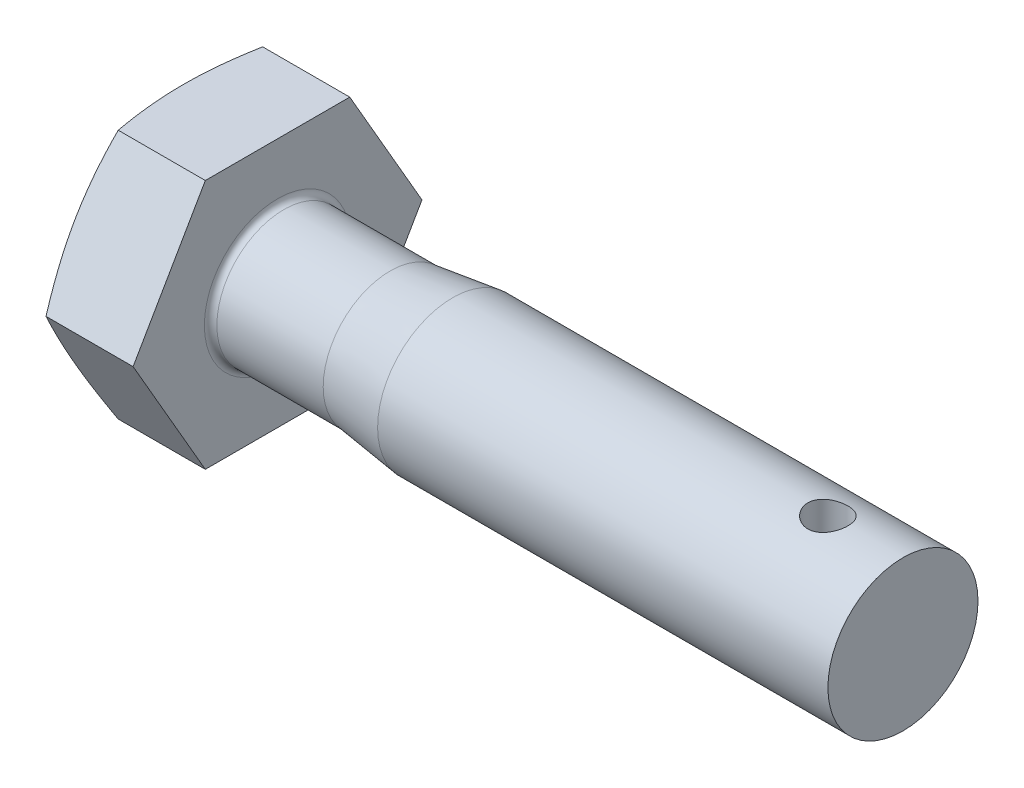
ISO-10303-21;
HEADER;
FILE_DESCRIPTION(('STEP AP214'),'2;1');
FILE_NAME('part.step','',(''),(''),'','','');
FILE_SCHEMA(('AUTOMOTIVE_DESIGN { 1 0 10303 214 1 1 1 1 }'));
ENDSEC;
DATA;
#1=APPLICATION_CONTEXT('core data for automotive mechanical design processes');
#2=APPLICATION_PROTOCOL_DEFINITION('international standard','automotive_design',2000,#1);
#3=PRODUCT_CONTEXT('',#1,'mechanical');
#4=PRODUCT('Part','Part','',(#3));
#5=PRODUCT_RELATED_PRODUCT_CATEGORY('part','',(#4));
#6=PRODUCT_DEFINITION_FORMATION('','',#4);
#7=PRODUCT_DEFINITION_CONTEXT('part definition',#1,'design');
#8=PRODUCT_DEFINITION('design','',#6,#7);
#9=PRODUCT_DEFINITION_SHAPE('','',#8);
#10=(LENGTH_UNIT() NAMED_UNIT(*) SI_UNIT(.MILLI.,.METRE.));
#11=(NAMED_UNIT(*) PLANE_ANGLE_UNIT() SI_UNIT($,.RADIAN.));
#12=(NAMED_UNIT(*) SI_UNIT($,.STERADIAN.) SOLID_ANGLE_UNIT());
#13=UNCERTAINTY_MEASURE_WITH_UNIT(LENGTH_MEASURE(1.E-05),#10,'distance_accuracy_value','');
#14=(GEOMETRIC_REPRESENTATION_CONTEXT(3) GLOBAL_UNCERTAINTY_ASSIGNED_CONTEXT((#13)) GLOBAL_UNIT_ASSIGNED_CONTEXT((#10,
#11,#12)) REPRESENTATION_CONTEXT('',''));
#15=CARTESIAN_POINT('',(0.,0.,0.));
#16=DIRECTION('',(0.,0.,1.));
#17=DIRECTION('',(1.,0.,0.));
#18=AXIS2_PLACEMENT_3D('',#15,#16,#17);
#19=CARTESIAN_POINT('',(0.,-5.,2.88675134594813));
#20=DIRECTION('',(-1.,0.,0.));
#21=DIRECTION('',(0.,0.,1.));
#22=AXIS2_PLACEMENT_3D('',#19,#20,#21);
#23=PLANE('',#22);
#24=CARTESIAN_POINT('',(0.,0.,0.));
#25=DIRECTION('',(-1.,0.,0.));
#26=DIRECTION('',(0.,0.,1.));
#27=AXIS2_PLACEMENT_3D('',#24,#25,#26);
#28=CIRCLE('',#27,4.35);
#29=CARTESIAN_POINT('',(0.,0.,4.35));
#30=VERTEX_POINT('',#29);
#31=EDGE_CURVE('E97',#30,#30,#28,.T.);
#32=ORIENTED_EDGE('',*,*,#31,.T.);
#33=EDGE_LOOP('',(#32));
#34=FACE_BOUND('',#33,.T.);
#35=CARTESIAN_POINT('',(0.,0.,0.));
#36=DIRECTION('',(1.,0.,0.));
#37=DIRECTION('',(0.,0.,-1.));
#38=AXIS2_PLACEMENT_3D('',#35,#36,#37);
#39=CIRCLE('',#38,3.4);
#40=CARTESIAN_POINT('',(0.,0.,-3.4));
#41=VERTEX_POINT('',#40);
#42=EDGE_CURVE('E230',#41,#41,#39,.T.);
#43=ORIENTED_EDGE('',*,*,#42,.T.);
#44=EDGE_LOOP('',(#43));
#45=FACE_BOUND('',#44,.T.);
#46=ADVANCED_FACE('F32',(#34,#45),#23,.T.);
#47=CARTESIAN_POINT('',(4.,-5.,2.88675134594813));
#48=DIRECTION('',(0.,1.,0.));
#49=DIRECTION('',(0.,0.,1.));
#50=AXIS2_PLACEMENT_3D('',#47,#48,#49);
#51=PLANE('',#50);
#52=CARTESIAN_POINT('',(1.73412088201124,-5.,-7.62058685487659));
#53=CARTESIAN_POINT('',(1.66536818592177,-5.,-7.39459725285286));
#54=CARTESIAN_POINT('',(1.5974227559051,-5.,-7.16835746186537));
#55=CARTESIAN_POINT('',(1.46359308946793,-5.,-6.71525017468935));
#56=CARTESIAN_POINT('',(1.39770901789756,-5.,-6.48838262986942));
#57=CARTESIAN_POINT('',(1.26833776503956,-5.,-6.03349928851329));
#58=CARTESIAN_POINT('',(1.20485534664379,-5.,-5.80548213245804));
#59=CARTESIAN_POINT('',(1.08103648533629,-5.,-5.34859642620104));
#60=CARTESIAN_POINT('',(1.02069998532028,-5.,-5.11972789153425));
#61=CARTESIAN_POINT('',(0.904681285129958,-5.,-4.66385371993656));
#62=CARTESIAN_POINT('',(0.848950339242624,-5.,-4.43686055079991));
#63=CARTESIAN_POINT('',(0.742270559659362,-5.,-3.98175526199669));
#64=CARTESIAN_POINT('',(0.691321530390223,-5.,-3.75364318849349));
#65=CARTESIAN_POINT('',(0.595395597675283,-5.,-3.29623351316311));
#66=CARTESIAN_POINT('',(0.550416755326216,-5.,-3.06693632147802));
#67=CARTESIAN_POINT('',(0.467808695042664,-5.,-2.60701194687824));
#68=CARTESIAN_POINT('',(0.43017922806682,-5.,-2.37638480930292));
#69=CARTESIAN_POINT('',(0.367531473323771,-5.,-1.93980954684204));
#70=CARTESIAN_POINT('',(0.341571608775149,-5.,-1.73399780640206));
#71=CARTESIAN_POINT('',(0.297702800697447,-5.,-1.32151095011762));
#72=CARTESIAN_POINT('',(0.279793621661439,-5.,-1.11483585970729));
#73=CARTESIAN_POINT('',(0.2528889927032,-5.,-0.701041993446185));
#74=CARTESIAN_POINT('',(0.243887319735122,-5.,-0.493923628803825));
#75=CARTESIAN_POINT('',(0.235252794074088,-5.,-0.0794895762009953));
#76=CARTESIAN_POINT('',(0.235619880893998,-5.,0.127826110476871));
#77=CARTESIAN_POINT('',(0.245728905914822,-5.,0.543296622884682));
#78=CARTESIAN_POINT('',(0.255519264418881,-5.,0.751450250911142));
#79=CARTESIAN_POINT('',(0.284025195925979,-5.,1.16714016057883));
#80=CARTESIAN_POINT('',(0.30274098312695,-5.,1.37467642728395));
#81=CARTESIAN_POINT('',(0.348227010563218,-5.,1.78903168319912));
#82=CARTESIAN_POINT('',(0.375004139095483,-5.,1.99584990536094));
#83=CARTESIAN_POINT('',(0.435533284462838,-5.,2.408451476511));
#84=CARTESIAN_POINT('',(0.469285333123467,-5.,2.61423482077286));
#85=CARTESIAN_POINT('',(0.544976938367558,-5.,3.03762754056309));
#86=CARTESIAN_POINT('',(0.587297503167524,-5.,3.25516820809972));
#87=CARTESIAN_POINT('',(0.677388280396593,-5.,3.68912540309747));
#88=CARTESIAN_POINT('',(0.72515891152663,-5.,3.90554184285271));
#89=CARTESIAN_POINT('',(0.825138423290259,-5.,4.3374083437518));
#90=CARTESIAN_POINT('',(0.877348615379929,-5.,4.55285809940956));
#91=CARTESIAN_POINT('',(0.985352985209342,-5.,4.98284735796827));
#92=CARTESIAN_POINT('',(1.04114707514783,-5.,5.19738688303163));
#93=CARTESIAN_POINT('',(1.15571790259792,-5.,5.62596240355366));
#94=CARTESIAN_POINT('',(1.2144984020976,-5.,5.83999738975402));
#95=CARTESIAN_POINT('',(1.33444153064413,-5.,6.26740010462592));
#96=CARTESIAN_POINT('',(1.395604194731,-5.,6.48076782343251));
#97=CARTESIAN_POINT('',(1.5819781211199,-5.,7.11994374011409));
#98=CARTESIAN_POINT('',(1.71009677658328,-5.,7.54490360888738));
#99=CARTESIAN_POINT('',(1.97013168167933,-5.,8.38829124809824));
#100=CARTESIAN_POINT('',(2.10198722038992,-5.,8.80673789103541));
#101=CARTESIAN_POINT('',(2.36941134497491,-5.,9.64246317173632));
#102=CARTESIAN_POINT('',(2.50498011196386,-5.,10.0597417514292));
#103=CARTESIAN_POINT('',(2.77829656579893,-5.,10.8918203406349));
#104=CARTESIAN_POINT('',(2.91603397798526,-5.,11.3066237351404));
#105=CARTESIAN_POINT('',(3.19355173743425,-5.,12.1355089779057));
#106=CARTESIAN_POINT('',(3.33333191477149,-5.,12.5495908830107));
#107=CARTESIAN_POINT('',(3.47382628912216,-5.,12.9634270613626));
#108=B_SPLINE_CURVE_WITH_KNOTS('',3,(#52,#53,#54,#55,#56,#57,#58,#59,#60,#61,#62,#63,#64,#65,
#66,#67,#68,#69,#70,#71,#72,#73,#74,#75,#76,#77,#78,#79,#80,#81,#82,#83,#84,#85,#86,#87,#88,#89,
#90,#91,#92,#93,#94,#95,#96,#97,#98,#99,#100,#101,#102,#103,#104,#105,#106,#107),.UNSPECIFIED.,
.F.,.F.,(4,2,2,2,2,2,2,2,2,2,2,2,2,2,2,2,2,2,2,2,2,2,2,2,2,2,2,4),(0.,0.708654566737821,
1.4173656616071,2.1274155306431,2.83745250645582,3.53861525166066,4.23974930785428,
4.94065510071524,5.64153713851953,6.26372739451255,6.88589944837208,7.50763652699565,
8.129369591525,8.75431450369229,9.37927441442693,10.0047698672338,10.6302681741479,
11.2950391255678,11.9598611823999,12.6248803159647,13.2898831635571,13.9557455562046,
14.6216177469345,15.9531168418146,17.269284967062,18.585517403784,19.8967329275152,
21.2078399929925),.UNSPECIFIED.);
#109=CARTESIAN_POINT('',(0.518112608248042,-5.,-2.88675134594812));
#110=VERTEX_POINT('',#109);
#111=CARTESIAN_POINT('',(0.518112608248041,-5.,2.88675134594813));
#112=VERTEX_POINT('',#111);
#113=EDGE_CURVE('E54',#110,#112,#108,.T.);
#114=ORIENTED_EDGE('',*,*,#113,.F.);
#115=DIRECTION('',(-1.,0.,0.));
#116=VECTOR('',#115,1.);
#117=CARTESIAN_POINT('',(4.,-5.,-2.88675134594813));
#118=LINE('',#117,#116);
#119=CARTESIAN_POINT('',(4.,-5.,-2.88675134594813));
#120=VERTEX_POINT('',#119);
#121=EDGE_CURVE('E122',#120,#110,#118,.T.);
#122=ORIENTED_EDGE('',*,*,#121,.F.);
#123=DIRECTION('',(0.,0.,-1.));
#124=VECTOR('',#123,1.);
#125=CARTESIAN_POINT('',(4.,-5.,2.88675134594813));
#126=LINE('',#125,#124);
#127=CARTESIAN_POINT('',(4.,-5.,2.88675134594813));
#128=VERTEX_POINT('',#127);
#129=EDGE_CURVE('E259',#128,#120,#126,.T.);
#130=ORIENTED_EDGE('',*,*,#129,.F.);
#131=DIRECTION('',(-1.,0.,0.));
#132=VECTOR('',#131,1.);
#133=CARTESIAN_POINT('',(4.,-5.,2.88675134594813));
#134=LINE('',#133,#132);
#135=EDGE_CURVE('E110',#128,#112,#134,.T.);
#136=ORIENTED_EDGE('',*,*,#135,.T.);
#137=EDGE_LOOP('',(#114,#122,#130,#136));
#138=FACE_BOUND('',#137,.T.);
#139=ADVANCED_FACE('F34',(#138),#51,.F.);
#140=CARTESIAN_POINT('',(4.,-5.,-2.88675134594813));
#141=DIRECTION('',(0.,0.5,0.866025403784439));
#142=DIRECTION('',(0.,-0.866025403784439,0.5));
#143=AXIS2_PLACEMENT_3D('',#140,#141,#142);
#144=PLANE('',#143);
#145=CARTESIAN_POINT('',(0.518154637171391,0.000200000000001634,-5.77361816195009));
#146=CARTESIAN_POINT('',(0.474622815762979,-0.206877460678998,-5.65406193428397));
#147=CARTESIAN_POINT('',(0.435023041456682,-0.414637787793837,-5.53411145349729));
#148=CARTESIAN_POINT('',(0.365353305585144,-0.83150936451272,-5.29343053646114));
#149=CARTESIAN_POINT('',(0.335290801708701,-1.04062154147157,-5.17269956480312));
#150=CARTESIAN_POINT('',(0.286665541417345,-1.45787607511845,-4.93179754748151));
#151=CARTESIAN_POINT('',(0.267996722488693,-1.66600890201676,-4.81163200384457));
#152=CARTESIAN_POINT('',(0.242956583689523,-2.08276129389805,-4.57101989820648));
#153=CARTESIAN_POINT('',(0.236580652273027,-2.29138064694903,-4.45057345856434));
#154=CARTESIAN_POINT('',(0.236580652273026,-2.70861935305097,-4.20968057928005));
#155=CARTESIAN_POINT('',(0.242956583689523,-2.91723870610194,-4.0892341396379));
#156=CARTESIAN_POINT('',(0.267996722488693,-3.33399109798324,-3.84862203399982));
#157=CARTESIAN_POINT('',(0.286665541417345,-3.54212392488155,-3.72845649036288));
#158=CARTESIAN_POINT('',(0.335290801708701,-3.95937845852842,-3.48755447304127));
#159=CARTESIAN_POINT('',(0.365353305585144,-4.16849063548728,-3.36682350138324));
#160=CARTESIAN_POINT('',(0.435023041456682,-4.58536221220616,-3.12614258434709));
#161=CARTESIAN_POINT('',(0.474622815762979,-4.793122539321,-3.00619210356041));
#162=CARTESIAN_POINT('',(0.518154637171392,-5.0002,-2.88663587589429));
#163=B_SPLINE_CURVE_WITH_KNOTS('',3,(#145,#146,#147,#148,#149,#150,#151,#152,#153,#154,#155,
#156,#157,#158,#159,#160,#161,#162),.UNSPECIFIED.,.F.,.F.,(4,2,2,2,2,2,2,2,4),(0.,
0.729203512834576,1.45897583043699,2.18184682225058,2.90444658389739,3.6270463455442,
4.3499173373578,5.07968965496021,5.80889316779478),.UNSPECIFIED.);
#164=CARTESIAN_POINT('',(0.518112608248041,0.,-5.77350269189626));
#165=VERTEX_POINT('',#164);
#166=EDGE_CURVE('E192',#165,#110,#163,.T.);
#167=ORIENTED_EDGE('',*,*,#166,.F.);
#168=DIRECTION('',(-1.,0.,0.));
#169=VECTOR('',#168,1.);
#170=CARTESIAN_POINT('',(4.,0.,-5.77350269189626));
#171=LINE('',#170,#169);
#172=CARTESIAN_POINT('',(4.,0.,-5.77350269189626));
#173=VERTEX_POINT('',#172);
#174=EDGE_CURVE('E119',#173,#165,#171,.T.);
#175=ORIENTED_EDGE('',*,*,#174,.F.);
#176=DIRECTION('',(0.,0.866025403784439,-0.5));
#177=VECTOR('',#176,1.);
#178=CARTESIAN_POINT('',(4.,-5.,-2.88675134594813));
#179=LINE('',#178,#177);
#180=EDGE_CURVE('E260',#120,#173,#179,.T.);
#181=ORIENTED_EDGE('',*,*,#180,.F.);
#182=ORIENTED_EDGE('',*,*,#121,.T.);
#183=EDGE_LOOP('',(#167,#175,#181,#182));
#184=FACE_BOUND('',#183,.T.);
#185=ADVANCED_FACE('F200',(#184),#144,.F.);
#186=CARTESIAN_POINT('',(4.,0.,-5.77350269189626));
#187=DIRECTION('',(0.,-0.5,0.866025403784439));
#188=DIRECTION('',(0.,-0.866025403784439,-0.5));
#189=AXIS2_PLACEMENT_3D('',#186,#187,#188);
#190=PLANE('',#189);
#191=CARTESIAN_POINT('',(0.518154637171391,5.0002,-2.88663587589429));
#192=CARTESIAN_POINT('',(0.474622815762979,4.793122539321,-3.00619210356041));
#193=CARTESIAN_POINT('',(0.435023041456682,4.58536221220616,-3.12614258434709));
#194=CARTESIAN_POINT('',(0.365353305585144,4.16849063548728,-3.36682350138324));
#195=CARTESIAN_POINT('',(0.335290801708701,3.95937845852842,-3.48755447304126));
#196=CARTESIAN_POINT('',(0.286665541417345,3.54212392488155,-3.72845649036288));
#197=CARTESIAN_POINT('',(0.267996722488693,3.33399109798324,-3.84862203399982));
#198=CARTESIAN_POINT('',(0.242956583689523,2.91723870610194,-4.0892341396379));
#199=CARTESIAN_POINT('',(0.236580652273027,2.70861935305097,-4.20968057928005));
#200=CARTESIAN_POINT('',(0.236580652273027,2.29138064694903,-4.45057345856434));
#201=CARTESIAN_POINT('',(0.242956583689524,2.08276129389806,-4.57101989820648));
#202=CARTESIAN_POINT('',(0.267996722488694,1.66600890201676,-4.81163200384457));
#203=CARTESIAN_POINT('',(0.286665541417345,1.45787607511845,-4.9317975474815));
#204=CARTESIAN_POINT('',(0.335290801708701,1.04062154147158,-5.17269956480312));
#205=CARTESIAN_POINT('',(0.365353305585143,0.831509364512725,-5.29343053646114));
#206=CARTESIAN_POINT('',(0.435023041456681,0.414637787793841,-5.53411145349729));
#207=CARTESIAN_POINT('',(0.474622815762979,0.206877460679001,-5.65406193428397));
#208=CARTESIAN_POINT('',(0.518154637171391,-0.000199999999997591,-5.77361816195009));
#209=B_SPLINE_CURVE_WITH_KNOTS('',3,(#191,#192,#193,#194,#195,#196,#197,#198,#199,#200,#201,
#202,#203,#204,#205,#206,#207,#208),.UNSPECIFIED.,.F.,.F.,(4,2,2,2,2,2,2,2,4),(0.,
0.729203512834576,1.45897583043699,2.18184682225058,2.90444658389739,3.6270463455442,
4.34991733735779,5.0796896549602,5.80889316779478),.UNSPECIFIED.);
#210=CARTESIAN_POINT('',(0.518112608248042,5.,-2.88675134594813));
#211=VERTEX_POINT('',#210);
#212=EDGE_CURVE('E186',#211,#165,#209,.T.);
#213=ORIENTED_EDGE('',*,*,#212,.F.);
#214=DIRECTION('',(-1.,0.,0.));
#215=VECTOR('',#214,1.);
#216=CARTESIAN_POINT('',(4.,5.,-2.88675134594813));
#217=LINE('',#216,#215);
#218=CARTESIAN_POINT('',(4.,5.,-2.88675134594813));
#219=VERTEX_POINT('',#218);
#220=EDGE_CURVE('E112',#219,#211,#217,.T.);
#221=ORIENTED_EDGE('',*,*,#220,.F.);
#222=DIRECTION('',(0.,0.866025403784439,0.5));
#223=VECTOR('',#222,1.);
#224=CARTESIAN_POINT('',(4.,0.,-5.77350269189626));
#225=LINE('',#224,#223);
#226=EDGE_CURVE('E264',#173,#219,#225,.T.);
#227=ORIENTED_EDGE('',*,*,#226,.F.);
#228=ORIENTED_EDGE('',*,*,#174,.T.);
#229=EDGE_LOOP('',(#213,#221,#227,#228));
#230=FACE_BOUND('',#229,.T.);
#231=ADVANCED_FACE('F203',(#230),#190,.F.);
#232=CARTESIAN_POINT('',(4.,5.,-2.88675134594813));
#233=DIRECTION('',(0.,-1.,0.));
#234=DIRECTION('',(0.,0.,-1.));
#235=AXIS2_PLACEMENT_3D('',#232,#233,#234);
#236=PLANE('',#235);
#237=CARTESIAN_POINT('',(1.73412088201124,5.,-7.62058685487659));
#238=CARTESIAN_POINT('',(1.66536818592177,5.,-7.39459725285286));
#239=CARTESIAN_POINT('',(1.5974227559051,5.,-7.16835746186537));
#240=CARTESIAN_POINT('',(1.46359308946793,5.,-6.71525017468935));
#241=CARTESIAN_POINT('',(1.39770901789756,5.,-6.48838262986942));
#242=CARTESIAN_POINT('',(1.26833776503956,5.,-6.03349928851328));
#243=CARTESIAN_POINT('',(1.20485534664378,5.,-5.80548213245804));
#244=CARTESIAN_POINT('',(1.08103648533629,5.,-5.34859642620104));
#245=CARTESIAN_POINT('',(1.02069998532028,5.,-5.11972789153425));
#246=CARTESIAN_POINT('',(0.904681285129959,5.,-4.66385371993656));
#247=CARTESIAN_POINT('',(0.848950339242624,5.,-4.43686055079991));
#248=CARTESIAN_POINT('',(0.742270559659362,5.,-3.98175526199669));
#249=CARTESIAN_POINT('',(0.691321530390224,5.,-3.75364318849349));
#250=CARTESIAN_POINT('',(0.595395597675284,5.,-3.29623351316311));
#251=CARTESIAN_POINT('',(0.550416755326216,5.,-3.06693632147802));
#252=CARTESIAN_POINT('',(0.467808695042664,5.,-2.60701194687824));
#253=CARTESIAN_POINT('',(0.43017922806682,5.,-2.37638480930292));
#254=CARTESIAN_POINT('',(0.367531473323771,5.,-1.93980954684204));
#255=CARTESIAN_POINT('',(0.341571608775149,5.,-1.73399780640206));
#256=CARTESIAN_POINT('',(0.297702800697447,5.,-1.32151095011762));
#257=CARTESIAN_POINT('',(0.279793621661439,5.,-1.11483585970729));
#258=CARTESIAN_POINT('',(0.252888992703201,5.,-0.701041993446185));
#259=CARTESIAN_POINT('',(0.243887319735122,5.,-0.493923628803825));
#260=CARTESIAN_POINT('',(0.235252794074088,5.,-0.0794895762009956));
#261=CARTESIAN_POINT('',(0.235619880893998,5.,0.12782611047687));
#262=CARTESIAN_POINT('',(0.245728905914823,5.,0.543296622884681));
#263=CARTESIAN_POINT('',(0.255519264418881,5.,0.751450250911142));
#264=CARTESIAN_POINT('',(0.28402519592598,5.,1.16714016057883));
#265=CARTESIAN_POINT('',(0.30274098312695,5.,1.37467642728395));
#266=CARTESIAN_POINT('',(0.348227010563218,5.,1.78903168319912));
#267=CARTESIAN_POINT('',(0.375004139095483,5.,1.99584990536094));
#268=CARTESIAN_POINT('',(0.435533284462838,5.,2.408451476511));
#269=CARTESIAN_POINT('',(0.469285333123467,5.,2.61423482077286));
#270=CARTESIAN_POINT('',(0.544976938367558,5.,3.03762754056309));
#271=CARTESIAN_POINT('',(0.587297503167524,5.,3.25516820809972));
#272=CARTESIAN_POINT('',(0.677388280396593,5.,3.68912540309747));
#273=CARTESIAN_POINT('',(0.72515891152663,5.,3.90554184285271));
#274=CARTESIAN_POINT('',(0.82513842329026,5.,4.3374083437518));
#275=CARTESIAN_POINT('',(0.877348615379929,5.,4.55285809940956));
#276=CARTESIAN_POINT('',(0.985352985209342,5.,4.98284735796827));
#277=CARTESIAN_POINT('',(1.04114707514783,5.,5.19738688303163));
#278=CARTESIAN_POINT('',(1.15571790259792,5.,5.62596240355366));
#279=CARTESIAN_POINT('',(1.2144984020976,5.,5.83999738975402));
#280=CARTESIAN_POINT('',(1.33444153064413,5.,6.26740010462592));
#281=CARTESIAN_POINT('',(1.395604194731,5.,6.48076782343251));
#282=CARTESIAN_POINT('',(1.5819781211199,5.,7.1199437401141));
#283=CARTESIAN_POINT('',(1.71009677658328,5.,7.54490360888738));
#284=CARTESIAN_POINT('',(1.97013168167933,5.,8.38829124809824));
#285=CARTESIAN_POINT('',(2.10198722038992,5.,8.80673789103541));
#286=CARTESIAN_POINT('',(2.36941134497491,5.,9.64246317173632));
#287=CARTESIAN_POINT('',(2.50498011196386,5.,10.0597417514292));
#288=CARTESIAN_POINT('',(2.77829656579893,5.,10.8918203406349));
#289=CARTESIAN_POINT('',(2.91603397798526,5.,11.3066237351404));
#290=CARTESIAN_POINT('',(3.19355173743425,5.,12.1355089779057));
#291=CARTESIAN_POINT('',(3.33333191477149,5.,12.5495908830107));
#292=CARTESIAN_POINT('',(3.47382628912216,5.,12.9634270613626));
#293=B_SPLINE_CURVE_WITH_KNOTS('',3,(#237,#238,#239,#240,#241,#242,#243,#244,#245,#246,#247,
#248,#249,#250,#251,#252,#253,#254,#255,#256,#257,#258,#259,#260,#261,#262,#263,#264,#265,#266,
#267,#268,#269,#270,#271,#272,#273,#274,#275,#276,#277,#278,#279,#280,#281,#282,#283,#284,#285,
#286,#287,#288,#289,#290,#291,#292),.UNSPECIFIED.,.F.,.F.,(4,2,2,2,2,2,2,2,2,2,2,2,2,2,2,2,2,2,
2,2,2,2,2,2,2,2,2,4),(0.,0.708654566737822,1.4173656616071,2.1274155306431,2.83745250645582,
3.53861525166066,4.23974930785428,4.94065510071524,5.64153713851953,6.26372739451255,
6.88589944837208,7.50763652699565,8.129369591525,8.75431450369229,9.37927441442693,
10.0047698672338,10.6302681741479,11.2950391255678,11.9598611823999,12.6248803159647,
13.2898831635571,13.9557455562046,14.6216177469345,15.9531168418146,17.269284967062,
18.585517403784,19.8967329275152,21.2078399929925),.UNSPECIFIED.);
#294=CARTESIAN_POINT('',(0.518112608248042,5.,2.88675134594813));
#295=VERTEX_POINT('',#294);
#296=EDGE_CURVE('E107',#295,#211,#293,.F.);
#297=ORIENTED_EDGE('',*,*,#296,.F.);
#298=DIRECTION('',(-1.,0.,0.));
#299=VECTOR('',#298,1.);
#300=CARTESIAN_POINT('',(4.,5.,2.88675134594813));
#301=LINE('',#300,#299);
#302=CARTESIAN_POINT('',(4.,5.,2.88675134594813));
#303=VERTEX_POINT('',#302);
#304=EDGE_CURVE('E106',#303,#295,#301,.T.);
#305=ORIENTED_EDGE('',*,*,#304,.F.);
#306=DIRECTION('',(0.,0.,1.));
#307=VECTOR('',#306,1.);
#308=CARTESIAN_POINT('',(4.,5.,-2.88675134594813));
#309=LINE('',#308,#307);
#310=EDGE_CURVE('E266',#219,#303,#309,.T.);
#311=ORIENTED_EDGE('',*,*,#310,.F.);
#312=ORIENTED_EDGE('',*,*,#220,.T.);
#313=EDGE_LOOP('',(#297,#305,#311,#312));
#314=FACE_BOUND('',#313,.T.);
#315=ADVANCED_FACE('F207',(#314),#236,.F.);
#316=CARTESIAN_POINT('',(4.,5.,2.88675134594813));
#317=DIRECTION('',(0.,-0.5,-0.866025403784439));
#318=DIRECTION('',(0.,0.866025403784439,-0.5));
#319=AXIS2_PLACEMENT_3D('',#316,#317,#318);
#320=PLANE('',#319);
#321=CARTESIAN_POINT('',(0.518154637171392,-0.000199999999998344,5.77361816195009));
#322=CARTESIAN_POINT('',(0.47462281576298,0.206877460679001,5.65406193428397));
#323=CARTESIAN_POINT('',(0.435023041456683,0.41463778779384,5.53411145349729));
#324=CARTESIAN_POINT('',(0.365353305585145,0.831509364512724,5.29343053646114));
#325=CARTESIAN_POINT('',(0.335290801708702,1.04062154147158,5.17269956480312));
#326=CARTESIAN_POINT('',(0.286665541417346,1.45787607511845,4.9317975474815));
#327=CARTESIAN_POINT('',(0.267996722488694,1.66600890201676,4.81163200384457));
#328=CARTESIAN_POINT('',(0.242956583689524,2.08276129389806,4.57101989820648));
#329=CARTESIAN_POINT('',(0.236580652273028,2.29138064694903,4.45057345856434));
#330=CARTESIAN_POINT('',(0.236580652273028,2.70861935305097,4.20968057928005));
#331=CARTESIAN_POINT('',(0.242956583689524,2.91723870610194,4.0892341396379));
#332=CARTESIAN_POINT('',(0.267996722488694,3.33399109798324,3.84862203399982));
#333=CARTESIAN_POINT('',(0.286665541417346,3.54212392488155,3.72845649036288));
#334=CARTESIAN_POINT('',(0.335290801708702,3.95937845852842,3.48755447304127));
#335=CARTESIAN_POINT('',(0.365353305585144,4.16849063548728,3.36682350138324));
#336=CARTESIAN_POINT('',(0.435023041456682,4.58536221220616,3.12614258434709));
#337=CARTESIAN_POINT('',(0.47462281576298,4.793122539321,3.00619210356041));
#338=CARTESIAN_POINT('',(0.518154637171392,5.0002,2.88663587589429));
#339=B_SPLINE_CURVE_WITH_KNOTS('',3,(#321,#322,#323,#324,#325,#326,#327,#328,#329,#330,#331,
#332,#333,#334,#335,#336,#337,#338),.UNSPECIFIED.,.F.,.F.,(4,2,2,2,2,2,2,2,4),(0.,
0.729203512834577,1.45897583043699,2.18184682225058,2.90444658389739,3.6270463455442,
4.34991733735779,5.0796896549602,5.80889316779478),.UNSPECIFIED.);
#340=CARTESIAN_POINT('',(0.518112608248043,0.,5.77350269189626));
#341=VERTEX_POINT('',#340);
#342=EDGE_CURVE('E92',#341,#295,#339,.T.);
#343=ORIENTED_EDGE('',*,*,#342,.F.);
#344=DIRECTION('',(-1.,0.,0.));
#345=VECTOR('',#344,1.);
#346=CARTESIAN_POINT('',(4.,0.,5.77350269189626));
#347=LINE('',#346,#345);
#348=CARTESIAN_POINT('',(4.,0.,5.77350269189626));
#349=VERTEX_POINT('',#348);
#350=EDGE_CURVE('E104',#349,#341,#347,.T.);
#351=ORIENTED_EDGE('',*,*,#350,.F.);
#352=DIRECTION('',(0.,-0.866025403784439,0.5));
#353=VECTOR('',#352,1.);
#354=CARTESIAN_POINT('',(4.,5.,2.88675134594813));
#355=LINE('',#354,#353);
#356=EDGE_CURVE('E268',#303,#349,#355,.T.);
#357=ORIENTED_EDGE('',*,*,#356,.F.);
#358=ORIENTED_EDGE('',*,*,#304,.T.);
#359=EDGE_LOOP('',(#343,#351,#357,#358));
#360=FACE_BOUND('',#359,.T.);
#361=ADVANCED_FACE('F102',(#360),#320,.F.);
#362=CARTESIAN_POINT('',(4.,0.,5.77350269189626));
#363=DIRECTION('',(0.,0.5,-0.866025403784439));
#364=DIRECTION('',(0.,0.866025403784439,0.5));
#365=AXIS2_PLACEMENT_3D('',#362,#363,#364);
#366=PLANE('',#365);
#367=CARTESIAN_POINT('',(0.518154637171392,-5.0002,2.88663587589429));
#368=CARTESIAN_POINT('',(0.47462281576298,-4.793122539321,3.00619210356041));
#369=CARTESIAN_POINT('',(0.435023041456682,-4.58536221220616,3.12614258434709));
#370=CARTESIAN_POINT('',(0.365353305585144,-4.16849063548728,3.36682350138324));
#371=CARTESIAN_POINT('',(0.335290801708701,-3.95937845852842,3.48755447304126));
#372=CARTESIAN_POINT('',(0.286665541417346,-3.54212392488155,3.72845649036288));
#373=CARTESIAN_POINT('',(0.267996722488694,-3.33399109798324,3.84862203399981));
#374=CARTESIAN_POINT('',(0.242956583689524,-2.91723870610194,4.0892341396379));
#375=CARTESIAN_POINT('',(0.236580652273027,-2.70861935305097,4.20968057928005));
#376=CARTESIAN_POINT('',(0.236580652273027,-2.29138064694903,4.45057345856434));
#377=CARTESIAN_POINT('',(0.242956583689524,-2.08276129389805,4.57101989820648));
#378=CARTESIAN_POINT('',(0.267996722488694,-1.66600890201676,4.81163200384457));
#379=CARTESIAN_POINT('',(0.286665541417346,-1.45787607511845,4.9317975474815));
#380=CARTESIAN_POINT('',(0.335290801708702,-1.04062154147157,5.17269956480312));
#381=CARTESIAN_POINT('',(0.365353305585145,-0.831509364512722,5.29343053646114));
#382=CARTESIAN_POINT('',(0.435023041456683,-0.414637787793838,5.53411145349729));
#383=CARTESIAN_POINT('',(0.47462281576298,-0.206877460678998,5.65406193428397));
#384=CARTESIAN_POINT('',(0.518154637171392,0.000200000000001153,5.77361816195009));
#385=B_SPLINE_CURVE_WITH_KNOTS('',3,(#367,#368,#369,#370,#371,#372,#373,#374,#375,#376,#377,
#378,#379,#380,#381,#382,#383,#384),.UNSPECIFIED.,.F.,.F.,(4,2,2,2,2,2,2,2,4),(0.,
0.729203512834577,1.45897583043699,2.18184682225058,2.90444658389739,3.6270463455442,
4.3499173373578,5.0796896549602,5.80889316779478),.UNSPECIFIED.);
#386=EDGE_CURVE('E89',#112,#341,#385,.T.);
#387=ORIENTED_EDGE('',*,*,#386,.F.);
#388=ORIENTED_EDGE('',*,*,#135,.F.);
#389=DIRECTION('',(0.,-0.866025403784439,-0.5));
#390=VECTOR('',#389,1.);
#391=CARTESIAN_POINT('',(4.,0.,5.77350269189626));
#392=LINE('',#391,#390);
#393=EDGE_CURVE('E62',#349,#128,#392,.T.);
#394=ORIENTED_EDGE('',*,*,#393,.F.);
#395=ORIENTED_EDGE('',*,*,#350,.T.);
#396=EDGE_LOOP('',(#387,#388,#394,#395));
#397=FACE_BOUND('',#396,.T.);
#398=ADVANCED_FACE('F109',(#397),#366,.F.);
#399=CARTESIAN_POINT('',(4.,-5.,2.88675134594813));
#400=DIRECTION('',(-1.,0.,0.));
#401=DIRECTION('',(0.,0.,1.));
#402=AXIS2_PLACEMENT_3D('',#399,#400,#401);
#403=PLANE('',#402);
#404=CARTESIAN_POINT('',(4.,0.,0.));
#405=DIRECTION('',(-1.,0.,0.));
#406=DIRECTION('',(0.,0.,1.));
#407=AXIS2_PLACEMENT_3D('',#404,#405,#406);
#408=CIRCLE('',#407,2.925);
#409=CARTESIAN_POINT('',(4.,0.,2.925));
#410=VERTEX_POINT('',#409);
#411=EDGE_CURVE('E46',#410,#410,#408,.T.);
#412=ORIENTED_EDGE('',*,*,#411,.T.);
#413=EDGE_LOOP('',(#412));
#414=FACE_BOUND('',#413,.T.);
#415=ORIENTED_EDGE('',*,*,#393,.T.);
#416=ORIENTED_EDGE('',*,*,#129,.T.);
#417=ORIENTED_EDGE('',*,*,#180,.T.);
#418=ORIENTED_EDGE('',*,*,#226,.T.);
#419=ORIENTED_EDGE('',*,*,#310,.T.);
#420=ORIENTED_EDGE('',*,*,#356,.T.);
#421=EDGE_LOOP('',(#415,#416,#417,#418,#419,#420));
#422=FACE_BOUND('',#421,.T.);
#423=ADVANCED_FACE('F163',(#414,#422),#403,.F.);
#424=CARTESIAN_POINT('',(0.,0.,0.));
#425=DIRECTION('',(1.,0.,0.));
#426=DIRECTION('',(0.,0.,-1.));
#427=AXIS2_PLACEMENT_3D('',#424,#425,#426);
#428=CONICAL_SURFACE('',#427,4.35,1.22173047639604);
#429=ORIENTED_EDGE('',*,*,#31,.F.);
#430=EDGE_LOOP('',(#429));
#431=FACE_BOUND('',#430,.T.);
#432=ORIENTED_EDGE('',*,*,#113,.T.);
#433=ORIENTED_EDGE('',*,*,#386,.T.);
#434=ORIENTED_EDGE('',*,*,#342,.T.);
#435=ORIENTED_EDGE('',*,*,#296,.T.);
#436=ORIENTED_EDGE('',*,*,#212,.T.);
#437=ORIENTED_EDGE('',*,*,#166,.T.);
#438=EDGE_LOOP('',(#432,#433,#434,#435,#436,#437));
#439=FACE_BOUND('',#438,.T.);
#440=ADVANCED_FACE('F91',(#431,#439),#428,.T.);
#441=CARTESIAN_POINT('',(0.8,0.,0.));
#442=DIRECTION('',(-1.,0.,0.));
#443=DIRECTION('',(0.,0.,1.));
#444=AXIS2_PLACEMENT_3D('',#441,#442,#443);
#445=CYLINDRICAL_SURFACE('',#444,3.4);
#446=CARTESIAN_POINT('',(0.8,0.,0.));
#447=DIRECTION('',(1.,0.,0.));
#448=DIRECTION('',(0.,0.,-1.));
#449=AXIS2_PLACEMENT_3D('',#446,#447,#448);
#450=CIRCLE('',#449,3.4);
#451=CARTESIAN_POINT('',(0.8,0.,-3.4));
#452=VERTEX_POINT('',#451);
#453=EDGE_CURVE('E232',#452,#452,#450,.T.);
#454=ORIENTED_EDGE('',*,*,#453,.T.);
#455=EDGE_LOOP('',(#454));
#456=FACE_BOUND('',#455,.T.);
#457=ORIENTED_EDGE('',*,*,#42,.F.);
#458=EDGE_LOOP('',(#457));
#459=FACE_BOUND('',#458,.T.);
#460=ADVANCED_FACE('F156',(#456,#459),#445,.F.);
#461=CARTESIAN_POINT('',(0.8,0.,0.));
#462=DIRECTION('',(1.,0.,0.));
#463=DIRECTION('',(0.,0.,-1.));
#464=AXIS2_PLACEMENT_3D('',#461,#462,#463);
#465=PLANE('',#464);
#466=ORIENTED_EDGE('',*,*,#453,.F.);
#467=EDGE_LOOP('',(#466));
#468=FACE_BOUND('',#467,.T.);
#469=ADVANCED_FACE('F152',(#468),#465,.F.);
#470=CARTESIAN_POINT('',(8.5,0.,0.));
#471=DIRECTION('',(1.,0.,0.));
#472=DIRECTION('',(0.,0.,-1.));
#473=AXIS2_PLACEMENT_3D('',#470,#471,#472);
#474=CONICAL_SURFACE('',#473,2.675,0.129275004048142);
#475=CARTESIAN_POINT('',(11.,0.,0.));
#476=DIRECTION('',(-1.,0.,0.));
#477=DIRECTION('',(0.,0.,1.));
#478=AXIS2_PLACEMENT_3D('',#475,#476,#477);
#479=CIRCLE('',#478,3.);
#480=CARTESIAN_POINT('',(11.,0.,3.));
#481=VERTEX_POINT('',#480);
#482=EDGE_CURVE('E233',#481,#481,#479,.T.);
#483=ORIENTED_EDGE('',*,*,#482,.T.);
#484=EDGE_LOOP('',(#483));
#485=FACE_BOUND('',#484,.T.);
#486=CARTESIAN_POINT('',(8.5,0.,0.));
#487=DIRECTION('',(-1.,0.,0.));
#488=DIRECTION('',(0.,0.,1.));
#489=AXIS2_PLACEMENT_3D('',#486,#487,#488);
#490=CIRCLE('',#489,2.675);
#491=CARTESIAN_POINT('',(8.5,0.,2.675));
#492=VERTEX_POINT('',#491);
#493=EDGE_CURVE('E238',#492,#492,#490,.T.);
#494=ORIENTED_EDGE('',*,*,#493,.F.);
#495=EDGE_LOOP('',(#494));
#496=FACE_BOUND('',#495,.T.);
#497=ADVANCED_FACE('F148',(#485,#496),#474,.T.);
#498=CARTESIAN_POINT('',(0.,0.,0.));
#499=DIRECTION('',(-1.,0.,0.));
#500=DIRECTION('',(0.,0.,1.));
#501=AXIS2_PLACEMENT_3D('',#498,#499,#500);
#502=CYLINDRICAL_SURFACE('',#501,2.675);
#503=CARTESIAN_POINT('',(4.25,0.,0.));
#504=DIRECTION('',(-1.,0.,0.));
#505=DIRECTION('',(0.,0.,1.));
#506=AXIS2_PLACEMENT_3D('',#503,#504,#505);
#507=CIRCLE('',#506,2.675);
#508=CARTESIAN_POINT('',(4.25,0.,2.675));
#509=VERTEX_POINT('',#508);
#510=EDGE_CURVE('E11',#509,#509,#507,.F.);
#511=ORIENTED_EDGE('',*,*,#510,.T.);
#512=EDGE_LOOP('',(#511));
#513=FACE_BOUND('',#512,.T.);
#514=ORIENTED_EDGE('',*,*,#493,.T.);
#515=EDGE_LOOP('',(#514));
#516=FACE_BOUND('',#515,.T.);
#517=ADVANCED_FACE('F144',(#513,#516),#502,.T.);
#518=CARTESIAN_POINT('',(29.,0.,0.));
#519=DIRECTION('',(1.,0.,0.));
#520=DIRECTION('',(0.,0.,-1.));
#521=AXIS2_PLACEMENT_3D('',#518,#519,#520);
#522=PLANE('',#521);
#523=CARTESIAN_POINT('',(29.,0.,0.));
#524=DIRECTION('',(1.,0.,0.));
#525=DIRECTION('',(0.,0.,-1.));
#526=AXIS2_PLACEMENT_3D('',#523,#524,#525);
#527=CIRCLE('',#526,3.);
#528=CARTESIAN_POINT('',(29.,0.,-3.));
#529=VERTEX_POINT('',#528);
#530=EDGE_CURVE('E255',#529,#529,#527,.T.);
#531=ORIENTED_EDGE('',*,*,#530,.T.);
#532=EDGE_LOOP('',(#531));
#533=FACE_BOUND('',#532,.T.);
#534=ADVANCED_FACE('F147',(#533),#522,.T.);
#535=CARTESIAN_POINT('',(29.,0.,0.));
#536=DIRECTION('',(-1.,0.,0.));
#537=DIRECTION('',(0.,0.,1.));
#538=AXIS2_PLACEMENT_3D('',#535,#536,#537);
#539=CYLINDRICAL_SURFACE('',#538,3.);
#540=CARTESIAN_POINT('',(26.,-2.89136645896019,0.799999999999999));
#541=CARTESIAN_POINT('',(26.0440703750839,-2.89136722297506,0.799998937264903));
#542=CARTESIAN_POINT('',(26.0881520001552,-2.89238505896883,0.796345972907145));
#543=CARTESIAN_POINT('',(26.1750421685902,-2.89633424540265,0.781858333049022));
#544=CARTESIAN_POINT('',(26.2178500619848,-2.89926655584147,0.771020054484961));
#545=CARTESIAN_POINT('',(26.3009232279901,-2.90668950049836,0.74254338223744));
#546=CARTESIAN_POINT('',(26.3411919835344,-2.91117794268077,0.724914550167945));
#547=CARTESIAN_POINT('',(26.4182066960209,-2.92120461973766,0.68338713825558));
#548=CARTESIAN_POINT('',(26.454952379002,-2.92674293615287,0.659488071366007));
#549=CARTESIAN_POINT('',(26.5247970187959,-2.93840055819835,0.605459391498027));
#550=CARTESIAN_POINT('',(26.557794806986,-2.94453016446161,0.575201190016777));
#551=CARTESIAN_POINT('',(26.6183126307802,-2.95659080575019,0.50958970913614));
#552=CARTESIAN_POINT('',(26.6458320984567,-2.96252182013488,0.474235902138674));
#553=CARTESIAN_POINT('',(26.6950339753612,-2.97363195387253,0.398735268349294));
#554=CARTESIAN_POINT('',(26.7166158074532,-2.97879750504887,0.358520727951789));
#555=CARTESIAN_POINT('',(26.7526738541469,-2.98767650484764,0.274873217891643));
#556=CARTESIAN_POINT('',(26.7671512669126,-2.99139019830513,0.231440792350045));
#557=CARTESIAN_POINT('',(26.7882620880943,-2.99687421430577,0.143646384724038));
#558=CARTESIAN_POINT('',(26.7950675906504,-2.99868710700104,0.099328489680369));
#559=CARTESIAN_POINT('',(26.8011828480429,-3.00031409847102,0.0101454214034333));
#560=CARTESIAN_POINT('',(26.8004938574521,-3.00012853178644,-0.034719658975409));
#561=CARTESIAN_POINT('',(26.7917608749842,-2.99781070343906,-0.122525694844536));
#562=CARTESIAN_POINT('',(26.7839028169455,-2.99572765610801,-0.165486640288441));
#563=CARTESIAN_POINT('',(26.7613551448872,-2.98990699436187,-0.249456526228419));
#564=CARTESIAN_POINT('',(26.7466651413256,-2.98616928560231,-0.290465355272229));
#565=CARTESIAN_POINT('',(26.710728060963,-2.97738627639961,-0.369841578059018));
#566=CARTESIAN_POINT('',(26.6894172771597,-2.97232835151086,-0.408178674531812));
#567=CARTESIAN_POINT('',(26.6408924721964,-2.96144987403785,-0.480795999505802));
#568=CARTESIAN_POINT('',(26.6136773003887,-2.95562917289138,-0.51507543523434));
#569=CARTESIAN_POINT('',(26.5531292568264,-2.94364509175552,-0.579714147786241));
#570=CARTESIAN_POINT('',(26.5196342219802,-2.93747667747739,-0.609920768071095));
#571=CARTESIAN_POINT('',(26.4479901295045,-2.92565362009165,-0.664325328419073));
#572=CARTESIAN_POINT('',(26.4098407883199,-2.91999900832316,-0.688522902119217));
#573=CARTESIAN_POINT('',(26.3296399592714,-2.90982360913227,-0.730338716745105));
#574=CARTESIAN_POINT('',(26.2875658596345,-2.90531002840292,-0.747915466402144));
#575=CARTESIAN_POINT('',(26.2009094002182,-2.89801730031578,-0.775696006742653));
#576=CARTESIAN_POINT('',(26.1563276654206,-2.89523772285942,-0.785901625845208));
#577=CARTESIAN_POINT('',(26.0673491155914,-2.89181934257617,-0.798387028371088));
#578=CARTESIAN_POINT('',(26.0229865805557,-2.89111905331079,-0.800894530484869));
#579=CARTESIAN_POINT('',(25.934476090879,-2.89177031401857,-0.798539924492));
#580=CARTESIAN_POINT('',(25.8903281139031,-2.89312164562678,-0.793678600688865));
#581=CARTESIAN_POINT('',(25.804377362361,-2.89766449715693,-0.776925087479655));
#582=CARTESIAN_POINT('',(25.7625458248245,-2.90082015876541,-0.765169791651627));
#583=CARTESIAN_POINT('',(25.6814481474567,-2.90858107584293,-0.73511594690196));
#584=CARTESIAN_POINT('',(25.6421823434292,-2.91318652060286,-0.716816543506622));
#585=CARTESIAN_POINT('',(25.5663780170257,-2.92345428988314,-0.673731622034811));
#586=CARTESIAN_POINT('',(25.5299184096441,-2.9291376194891,-0.648812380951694));
#587=CARTESIAN_POINT('',(25.4616146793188,-2.94087136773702,-0.593360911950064));
#588=CARTESIAN_POINT('',(25.4297714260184,-2.94692185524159,-0.562827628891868));
#589=CARTESIAN_POINT('',(25.3706590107,-2.95891985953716,-0.495961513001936));
#590=CARTESIAN_POINT('',(25.3435486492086,-2.96485934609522,-0.459486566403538));
#591=CARTESIAN_POINT('',(25.2958356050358,-2.97578668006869,-0.382371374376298));
#592=CARTESIAN_POINT('',(25.2752325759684,-2.98077457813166,-0.341731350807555));
#593=CARTESIAN_POINT('',(25.2413081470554,-2.989204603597,-0.257725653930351));
#594=CARTESIAN_POINT('',(25.2279323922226,-2.99265823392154,-0.214383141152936));
#595=CARTESIAN_POINT('',(25.2086845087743,-2.99768121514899,-0.125959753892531));
#596=CARTESIAN_POINT('',(25.2028107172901,-2.99925098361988,-0.0808792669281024));
#597=CARTESIAN_POINT('',(25.1988376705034,-3.0003096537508,0.00825680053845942));
#598=CARTESIAN_POINT('',(25.2005054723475,-2.99986090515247,0.0523014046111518));
#599=CARTESIAN_POINT('',(25.2110273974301,-2.9970739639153,0.139459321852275));
#600=CARTESIAN_POINT('',(25.2198812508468,-2.99473584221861,0.182572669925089));
#601=CARTESIAN_POINT('',(25.2443922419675,-2.98844524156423,0.266364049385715));
#602=CARTESIAN_POINT('',(25.2600021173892,-2.9845039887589,0.307056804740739));
#603=CARTESIAN_POINT('',(25.2975398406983,-2.975419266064,0.385268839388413));
#604=CARTESIAN_POINT('',(25.3194685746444,-2.97027562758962,0.422787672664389));
#605=CARTESIAN_POINT('',(25.3697033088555,-2.95916532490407,0.494671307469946));
#606=CARTESIAN_POINT('',(25.3981637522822,-2.95318037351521,0.528925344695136));
#607=CARTESIAN_POINT('',(25.4603610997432,-2.94113600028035,0.592250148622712));
#608=CARTESIAN_POINT('',(25.4940993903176,-2.93507655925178,0.621319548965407));
#609=CARTESIAN_POINT('',(25.5667873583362,-2.92341583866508,0.674082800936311));
#610=CARTESIAN_POINT('',(25.6058353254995,-2.91782756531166,0.697644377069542));
#611=CARTESIAN_POINT('',(25.6874825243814,-2.90792557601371,0.737834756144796));
#612=CARTESIAN_POINT('',(25.7300794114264,-2.90361102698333,0.754468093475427));
#613=CARTESIAN_POINT('',(25.8104325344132,-2.89734400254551,0.778152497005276));
#614=CARTESIAN_POINT('',(25.8478405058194,-2.89512056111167,0.786326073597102));
#615=CARTESIAN_POINT('',(25.9234962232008,-2.8921315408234,0.79724997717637));
#616=CARTESIAN_POINT('',(25.9617438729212,-2.89136579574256,0.800000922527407));
#617=CARTESIAN_POINT('',(26.,-2.89136645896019,0.799999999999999));
#618=B_SPLINE_CURVE_WITH_KNOTS('',3,(#540,#541,#542,#543,#544,#545,#546,#547,#548,#549,#550,
#551,#552,#553,#554,#555,#556,#557,#558,#559,#560,#561,#562,#563,#564,#565,#566,#567,#568,#569,
#570,#571,#572,#573,#574,#575,#576,#577,#578,#579,#580,#581,#582,#583,#584,#585,#586,#587,#588,
#589,#590,#591,#592,#593,#594,#595,#596,#597,#598,#599,#600,#601,#602,#603,#604,#605,#606,#607,
#608,#609,#610,#611,#612,#613,#614,#615,#616,#617),.UNSPECIFIED.,.T.,.F.,(4,2,2,2,2,2,2,2,2,2,2,
2,2,2,2,2,2,2,2,2,2,2,2,2,2,2,2,2,2,2,2,2,2,2,2,2,2,2,4),(0.,0.132070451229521,
0.264207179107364,0.396158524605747,0.528120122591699,0.663063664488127,0.798021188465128,
0.935140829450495,1.07223733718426,1.2061932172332,1.34012667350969,1.4706822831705,
1.60124533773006,1.73310579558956,1.86499197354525,2.0009270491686,2.1368704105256,
2.27365206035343,2.41039976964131,2.54306133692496,2.67570878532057,2.80580740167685,
2.93592301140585,3.06889853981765,3.20189908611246,3.33874362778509,3.47558088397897,
3.61137415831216,3.74713732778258,3.87873621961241,4.01033017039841,4.14101805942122,
4.27172428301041,4.40591541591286,4.54014186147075,4.67732015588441,4.81440852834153,
4.92906787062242,5.04371413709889),.UNSPECIFIED.);
#619=CARTESIAN_POINT('',(26.,-2.89136645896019,0.799999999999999));
#620=VERTEX_POINT('',#619);
#621=EDGE_CURVE('E37',#620,#620,#618,.T.);
#622=ORIENTED_EDGE('',*,*,#621,.T.);
#623=EDGE_LOOP('',(#622));
#624=FACE_BOUND('',#623,.T.);
#625=CARTESIAN_POINT('',(26.,2.89136645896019,0.799999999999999));
#626=CARTESIAN_POINT('',(25.9559296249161,2.89136722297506,0.799998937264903));
#627=CARTESIAN_POINT('',(25.9118479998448,2.89238505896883,0.796345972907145));
#628=CARTESIAN_POINT('',(25.8249578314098,2.89633424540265,0.781858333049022));
#629=CARTESIAN_POINT('',(25.7821499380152,2.89926655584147,0.771020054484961));
#630=CARTESIAN_POINT('',(25.6990767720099,2.90668950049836,0.74254338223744));
#631=CARTESIAN_POINT('',(25.6588080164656,2.91117794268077,0.724914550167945));
#632=CARTESIAN_POINT('',(25.5817933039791,2.92120461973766,0.68338713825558));
#633=CARTESIAN_POINT('',(25.545047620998,2.92674293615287,0.659488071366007));
#634=CARTESIAN_POINT('',(25.4752029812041,2.93840055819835,0.605459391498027));
#635=CARTESIAN_POINT('',(25.442205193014,2.94453016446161,0.575201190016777));
#636=CARTESIAN_POINT('',(25.3816873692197,2.95659080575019,0.50958970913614));
#637=CARTESIAN_POINT('',(25.3541679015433,2.96252182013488,0.474235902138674));
#638=CARTESIAN_POINT('',(25.3049660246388,2.97363195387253,0.398735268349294));
#639=CARTESIAN_POINT('',(25.2833841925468,2.97879750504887,0.358520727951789));
#640=CARTESIAN_POINT('',(25.2473261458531,2.98767650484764,0.274873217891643));
#641=CARTESIAN_POINT('',(25.2328487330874,2.99139019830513,0.231440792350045));
#642=CARTESIAN_POINT('',(25.2117379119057,2.99687421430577,0.143646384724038));
#643=CARTESIAN_POINT('',(25.2049324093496,2.99868710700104,0.0993284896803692));
#644=CARTESIAN_POINT('',(25.1988171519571,3.00031409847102,0.0101454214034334));
#645=CARTESIAN_POINT('',(25.1995061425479,3.00012853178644,-0.0347196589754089));
#646=CARTESIAN_POINT('',(25.2082391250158,2.99781070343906,-0.122525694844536));
#647=CARTESIAN_POINT('',(25.2160971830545,2.99572765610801,-0.165486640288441));
#648=CARTESIAN_POINT('',(25.2386448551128,2.98990699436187,-0.249456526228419));
#649=CARTESIAN_POINT('',(25.2533348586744,2.98616928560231,-0.290465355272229));
#650=CARTESIAN_POINT('',(25.289271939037,2.97738627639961,-0.369841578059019));
#651=CARTESIAN_POINT('',(25.3105827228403,2.97232835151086,-0.408178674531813));
#652=CARTESIAN_POINT('',(25.3591075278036,2.96144987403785,-0.480795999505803));
#653=CARTESIAN_POINT('',(25.3863226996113,2.95562917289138,-0.51507543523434));
#654=CARTESIAN_POINT('',(25.4468707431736,2.94364509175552,-0.579714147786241));
#655=CARTESIAN_POINT('',(25.4803657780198,2.93747667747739,-0.609920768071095));
#656=CARTESIAN_POINT('',(25.5520098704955,2.92565362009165,-0.664325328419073));
#657=CARTESIAN_POINT('',(25.5901592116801,2.91999900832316,-0.688522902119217));
#658=CARTESIAN_POINT('',(25.6703600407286,2.90982360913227,-0.730338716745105));
#659=CARTESIAN_POINT('',(25.7124341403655,2.90531002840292,-0.747915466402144));
#660=CARTESIAN_POINT('',(25.7990905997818,2.89801730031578,-0.775696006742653));
#661=CARTESIAN_POINT('',(25.8436723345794,2.89523772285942,-0.785901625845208));
#662=CARTESIAN_POINT('',(25.9326508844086,2.89181934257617,-0.798387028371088));
#663=CARTESIAN_POINT('',(25.9770134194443,2.89111905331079,-0.800894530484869));
#664=CARTESIAN_POINT('',(26.065523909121,2.89177031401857,-0.798539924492));
#665=CARTESIAN_POINT('',(26.1096718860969,2.89312164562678,-0.793678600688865));
#666=CARTESIAN_POINT('',(26.195622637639,2.89766449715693,-0.776925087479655));
#667=CARTESIAN_POINT('',(26.2374541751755,2.90082015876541,-0.765169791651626));
#668=CARTESIAN_POINT('',(26.3185518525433,2.90858107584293,-0.735115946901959));
#669=CARTESIAN_POINT('',(26.3578176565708,2.91318652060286,-0.716816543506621));
#670=CARTESIAN_POINT('',(26.4336219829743,2.92345428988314,-0.673731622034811));
#671=CARTESIAN_POINT('',(26.4700815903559,2.9291376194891,-0.648812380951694));
#672=CARTESIAN_POINT('',(26.5383853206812,2.94087136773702,-0.593360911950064));
#673=CARTESIAN_POINT('',(26.5702285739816,2.94692185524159,-0.562827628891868));
#674=CARTESIAN_POINT('',(26.6293409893,2.95891985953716,-0.495961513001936));
#675=CARTESIAN_POINT('',(26.6564513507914,2.96485934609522,-0.459486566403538));
#676=CARTESIAN_POINT('',(26.7041643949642,2.97578668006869,-0.382371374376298));
#677=CARTESIAN_POINT('',(26.7247674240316,2.98077457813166,-0.341731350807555));
#678=CARTESIAN_POINT('',(26.7586918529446,2.989204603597,-0.257725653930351));
#679=CARTESIAN_POINT('',(26.7720676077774,2.99265823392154,-0.214383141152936));
#680=CARTESIAN_POINT('',(26.7913154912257,2.99768121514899,-0.125959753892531));
#681=CARTESIAN_POINT('',(26.7971892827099,2.99925098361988,-0.0808792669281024));
#682=CARTESIAN_POINT('',(26.8011623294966,3.0003096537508,0.00825680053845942));
#683=CARTESIAN_POINT('',(26.7994945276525,2.99986090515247,0.0523014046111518));
#684=CARTESIAN_POINT('',(26.7889726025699,2.9970739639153,0.139459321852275));
#685=CARTESIAN_POINT('',(26.7801187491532,2.99473584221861,0.182572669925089));
#686=CARTESIAN_POINT('',(26.7556077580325,2.98844524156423,0.266364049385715));
#687=CARTESIAN_POINT('',(26.7399978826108,2.9845039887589,0.307056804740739));
#688=CARTESIAN_POINT('',(26.7024601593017,2.975419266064,0.385268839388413));
#689=CARTESIAN_POINT('',(26.6805314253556,2.97027562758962,0.42278767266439));
#690=CARTESIAN_POINT('',(26.6302966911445,2.95916532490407,0.494671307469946));
#691=CARTESIAN_POINT('',(26.6018362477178,2.95318037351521,0.528925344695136));
#692=CARTESIAN_POINT('',(26.5396389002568,2.94113600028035,0.592250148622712));
#693=CARTESIAN_POINT('',(26.5059006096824,2.93507655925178,0.621319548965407));
#694=CARTESIAN_POINT('',(26.4332126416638,2.92341583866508,0.674082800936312));
#695=CARTESIAN_POINT('',(26.3941646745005,2.91782756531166,0.697644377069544));
#696=CARTESIAN_POINT('',(26.3125174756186,2.90792557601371,0.737834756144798));
#697=CARTESIAN_POINT('',(26.2699205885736,2.90361102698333,0.754468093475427));
#698=CARTESIAN_POINT('',(26.1895674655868,2.89734400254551,0.778152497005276));
#699=CARTESIAN_POINT('',(26.1521594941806,2.89512056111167,0.786326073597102));
#700=CARTESIAN_POINT('',(26.0765037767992,2.8921315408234,0.79724997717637));
#701=CARTESIAN_POINT('',(26.0382561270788,2.89136579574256,0.800000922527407));
#702=CARTESIAN_POINT('',(26.,2.89136645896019,0.799999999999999));
#703=B_SPLINE_CURVE_WITH_KNOTS('',3,(#625,#626,#627,#628,#629,#630,#631,#632,#633,#634,#635,
#636,#637,#638,#639,#640,#641,#642,#643,#644,#645,#646,#647,#648,#649,#650,#651,#652,#653,#654,
#655,#656,#657,#658,#659,#660,#661,#662,#663,#664,#665,#666,#667,#668,#669,#670,#671,#672,#673,
#674,#675,#676,#677,#678,#679,#680,#681,#682,#683,#684,#685,#686,#687,#688,#689,#690,#691,#692,
#693,#694,#695,#696,#697,#698,#699,#700,#701,#702),.UNSPECIFIED.,.T.,.F.,(4,2,2,2,2,2,2,2,2,2,2,
2,2,2,2,2,2,2,2,2,2,2,2,2,2,2,2,2,2,2,2,2,2,2,2,2,2,2,4),(0.,0.132070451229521,
0.264207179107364,0.396158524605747,0.528120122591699,0.663063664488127,0.798021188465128,
0.935140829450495,1.07223733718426,1.2061932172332,1.34012667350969,1.4706822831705,
1.60124533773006,1.73310579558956,1.86499197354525,2.0009270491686,2.1368704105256,
2.27365206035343,2.41039976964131,2.54306133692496,2.67570878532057,2.80580740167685,
2.93592301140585,3.06889853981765,3.20189908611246,3.33874362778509,3.47558088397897,
3.61137415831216,3.74713732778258,3.87873621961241,4.01033017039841,4.14101805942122,
4.27172428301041,4.40591541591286,4.54014186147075,4.67732015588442,4.81440852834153,
4.92906787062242,5.04371413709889),.UNSPECIFIED.);
#704=CARTESIAN_POINT('',(26.,2.89136645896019,0.799999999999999));
#705=VERTEX_POINT('',#704);
#706=EDGE_CURVE('E126',#705,#705,#703,.T.);
#707=ORIENTED_EDGE('',*,*,#706,.T.);
#708=EDGE_LOOP('',(#707));
#709=FACE_BOUND('',#708,.T.);
#710=ORIENTED_EDGE('',*,*,#530,.F.);
#711=EDGE_LOOP('',(#710));
#712=FACE_BOUND('',#711,.T.);
#713=ORIENTED_EDGE('',*,*,#482,.F.);
#714=EDGE_LOOP('',(#713));
#715=FACE_BOUND('',#714,.T.);
#716=ADVANCED_FACE('F130',(#624,#709,#712,#715),#539,.T.);
#717=CARTESIAN_POINT('',(4.25,0.,0.));
#718=DIRECTION('',(-1.,0.,0.));
#719=DIRECTION('',(0.,0.,1.));
#720=AXIS2_PLACEMENT_3D('',#717,#718,#719);
#721=TOROIDAL_SURFACE('',#720,2.925,0.25);
#722=ORIENTED_EDGE('',*,*,#510,.F.);
#723=EDGE_LOOP('',(#722));
#724=FACE_BOUND('',#723,.T.);
#725=ORIENTED_EDGE('',*,*,#411,.F.);
#726=EDGE_LOOP('',(#725));
#727=FACE_BOUND('',#726,.T.);
#728=ADVANCED_FACE('F138',(#724,#727),#721,.F.);
#729=CARTESIAN_POINT('',(26.,-5.,0.));
#730=DIRECTION('',(0.,1.,0.));
#731=DIRECTION('',(0.,0.,1.));
#732=AXIS2_PLACEMENT_3D('',#729,#730,#731);
#733=CYLINDRICAL_SURFACE('',#732,0.799999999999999);
#734=ORIENTED_EDGE('',*,*,#706,.F.);
#735=EDGE_LOOP('',(#734));
#736=FACE_BOUND('',#735,.T.);
#737=ORIENTED_EDGE('',*,*,#621,.F.);
#738=EDGE_LOOP('',(#737));
#739=FACE_BOUND('',#738,.T.);
#740=ADVANCED_FACE('F134',(#736,#739),#733,.F.);
#741=CLOSED_SHELL('',(#46,#139,#185,#231,#315,#361,#398,#423,#440,#460,#469,#497,#517,#534,#716,
#728,#740));
#742=MANIFOLD_SOLID_BREP('B2',#741);
#743=ADVANCED_BREP_SHAPE_REPRESENTATION('',(#18,#742),#14);
#744=SHAPE_DEFINITION_REPRESENTATION(#9,#743);
ENDSEC;
END-ISO-10303-21;
